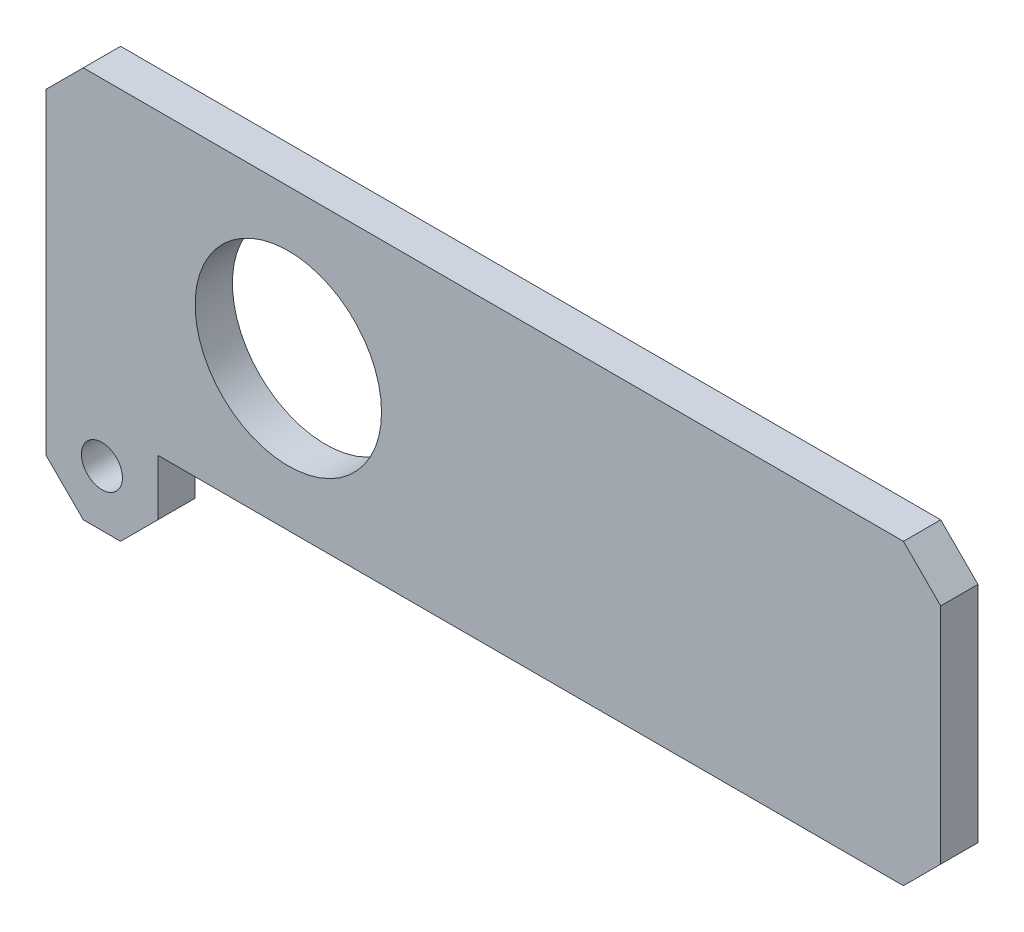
ISO-10303-21;
HEADER;
FILE_DESCRIPTION(('STEP AP214'),'2;1');
FILE_NAME('part.step','',(''),(''),'','','');
FILE_SCHEMA(('AUTOMOTIVE_DESIGN { 1 0 10303 214 1 1 1 1 }'));
ENDSEC;
DATA;
#1=APPLICATION_CONTEXT('core data for automotive mechanical design processes');
#2=APPLICATION_PROTOCOL_DEFINITION('international standard','automotive_design',2000,#1);
#3=PRODUCT_CONTEXT('',#1,'mechanical');
#4=PRODUCT('Part','Part','',(#3));
#5=PRODUCT_RELATED_PRODUCT_CATEGORY('part','',(#4));
#6=PRODUCT_DEFINITION_FORMATION('','',#4);
#7=PRODUCT_DEFINITION_CONTEXT('part definition',#1,'design');
#8=PRODUCT_DEFINITION('design','',#6,#7);
#9=PRODUCT_DEFINITION_SHAPE('','',#8);
#10=(LENGTH_UNIT() NAMED_UNIT(*) SI_UNIT(.MILLI.,.METRE.));
#11=(NAMED_UNIT(*) PLANE_ANGLE_UNIT() SI_UNIT($,.RADIAN.));
#12=(NAMED_UNIT(*) SI_UNIT($,.STERADIAN.) SOLID_ANGLE_UNIT());
#13=UNCERTAINTY_MEASURE_WITH_UNIT(LENGTH_MEASURE(1.E-05),#10,'distance_accuracy_value','');
#14=(GEOMETRIC_REPRESENTATION_CONTEXT(3) GLOBAL_UNCERTAINTY_ASSIGNED_CONTEXT((#13)) GLOBAL_UNIT_ASSIGNED_CONTEXT((#10,
#11,#12)) REPRESENTATION_CONTEXT('',''));
#15=CARTESIAN_POINT('',(0.,0.,0.));
#16=DIRECTION('',(0.,0.,1.));
#17=DIRECTION('',(1.,0.,0.));
#18=AXIS2_PLACEMENT_3D('',#15,#16,#17);
#19=CARTESIAN_POINT('',(30.,0.,10.));
#20=DIRECTION('',(0.,0.,1.));
#21=DIRECTION('',(1.,0.,0.));
#22=AXIS2_PLACEMENT_3D('',#19,#20,#21);
#23=PLANE('',#22);
#24=CARTESIAN_POINT('',(65.,65.,10.));
#25=DIRECTION('',(0.,0.,1.));
#26=DIRECTION('',(1.,0.,0.));
#27=AXIS2_PLACEMENT_3D('',#24,#25,#26);
#28=CIRCLE('',#27,25.);
#29=CARTESIAN_POINT('',(90.,65.,10.));
#30=VERTEX_POINT('',#29);
#31=EDGE_CURVE('E148',#30,#30,#28,.T.);
#32=ORIENTED_EDGE('',*,*,#31,.F.);
#33=EDGE_LOOP('',(#32));
#34=FACE_BOUND('',#33,.T.);
#35=DIRECTION('',(1.,0.,0.));
#36=VECTOR('',#35,1.);
#37=CARTESIAN_POINT('',(240.,25.,10.));
#38=LINE('',#37,#36);
#39=CARTESIAN_POINT('',(30.,25.,10.));
#40=VERTEX_POINT('',#39);
#41=CARTESIAN_POINT('',(230.,25.,10.));
#42=VERTEX_POINT('',#41);
#43=EDGE_CURVE('E118',#40,#42,#38,.T.);
#44=ORIENTED_EDGE('',*,*,#43,.T.);
#45=DIRECTION('',(-0.70710678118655,-0.707106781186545,0.));
#46=VECTOR('',#45,1.);
#47=CARTESIAN_POINT('',(117.499999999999,-87.4999999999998,10.));
#48=LINE('',#47,#46);
#49=CARTESIAN_POINT('',(240.,35.,10.));
#50=VERTEX_POINT('',#49);
#51=EDGE_CURVE('E11',#42,#50,#48,.F.);
#52=ORIENTED_EDGE('',*,*,#51,.T.);
#53=DIRECTION('',(0.,1.,0.));
#54=VECTOR('',#53,1.);
#55=CARTESIAN_POINT('',(240.,105.,10.));
#56=LINE('',#55,#54);
#57=CARTESIAN_POINT('',(240.,95.,10.));
#58=VERTEX_POINT('',#57);
#59=EDGE_CURVE('E137',#50,#58,#56,.T.);
#60=ORIENTED_EDGE('',*,*,#59,.T.);
#61=DIRECTION('',(0.707106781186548,-0.707106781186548,0.));
#62=VECTOR('',#61,1.);
#63=CARTESIAN_POINT('',(182.5,152.5,10.));
#64=LINE('',#63,#62);
#65=CARTESIAN_POINT('',(230.,105.,10.));
#66=VERTEX_POINT('',#65);
#67=EDGE_CURVE('E195',#58,#66,#64,.F.);
#68=ORIENTED_EDGE('',*,*,#67,.T.);
#69=DIRECTION('',(-1.,0.,0.));
#70=VECTOR('',#69,1.);
#71=CARTESIAN_POINT('',(0.,105.,10.));
#72=LINE('',#71,#70);
#73=CARTESIAN_POINT('',(10.,105.,10.));
#74=VERTEX_POINT('',#73);
#75=EDGE_CURVE('E139',#66,#74,#72,.T.);
#76=ORIENTED_EDGE('',*,*,#75,.T.);
#77=DIRECTION('',(0.707106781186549,0.707106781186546,0.));
#78=VECTOR('',#77,1.);
#79=CARTESIAN_POINT('',(-32.4999999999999,62.5000000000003,10.));
#80=LINE('',#79,#78);
#81=CARTESIAN_POINT('',(0.,95.,10.));
#82=VERTEX_POINT('',#81);
#83=EDGE_CURVE('E184',#74,#82,#80,.F.);
#84=ORIENTED_EDGE('',*,*,#83,.T.);
#85=DIRECTION('',(0.,-1.,0.));
#86=VECTOR('',#85,1.);
#87=CARTESIAN_POINT('',(0.,0.,10.));
#88=LINE('',#87,#86);
#89=CARTESIAN_POINT('',(0.,10.0000000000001,10.));
#90=VERTEX_POINT('',#89);
#91=EDGE_CURVE('E134',#82,#90,#88,.T.);
#92=ORIENTED_EDGE('',*,*,#91,.T.);
#93=DIRECTION('',(-0.707106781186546,0.707106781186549,0.));
#94=VECTOR('',#93,1.);
#95=CARTESIAN_POINT('',(19.9999999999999,-9.99999999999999,10.));
#96=LINE('',#95,#94);
#97=CARTESIAN_POINT('',(10.,0.,10.));
#98=VERTEX_POINT('',#97);
#99=EDGE_CURVE('E166',#90,#98,#96,.F.);
#100=ORIENTED_EDGE('',*,*,#99,.T.);
#101=DIRECTION('',(1.,0.,0.));
#102=VECTOR('',#101,1.);
#103=CARTESIAN_POINT('',(30.,0.,10.));
#104=LINE('',#103,#102);
#105=CARTESIAN_POINT('',(19.9999999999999,0.,10.));
#106=VERTEX_POINT('',#105);
#107=EDGE_CURVE('E126',#98,#106,#104,.T.);
#108=ORIENTED_EDGE('',*,*,#107,.T.);
#109=DIRECTION('',(-0.70710678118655,-0.707106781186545,0.));
#110=VECTOR('',#109,1.);
#111=CARTESIAN_POINT('',(25.,5.00000000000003,10.));
#112=LINE('',#111,#110);
#113=CARTESIAN_POINT('',(30.,10.,10.));
#114=VERTEX_POINT('',#113);
#115=EDGE_CURVE('E122',#106,#114,#112,.F.);
#116=ORIENTED_EDGE('',*,*,#115,.T.);
#117=DIRECTION('',(0.,1.,0.));
#118=VECTOR('',#117,1.);
#119=CARTESIAN_POINT('',(30.,25.,10.));
#120=LINE('',#119,#118);
#121=EDGE_CURVE('E115',#114,#40,#120,.T.);
#122=ORIENTED_EDGE('',*,*,#121,.T.);
#123=EDGE_LOOP('',(#44,#52,#60,#68,#76,#84,#92,#100,#108,#116,#122));
#124=FACE_BOUND('',#123,.T.);
#125=CARTESIAN_POINT('',(15.,15.,10.));
#126=DIRECTION('',(0.,0.,1.));
#127=DIRECTION('',(1.,0.,0.));
#128=AXIS2_PLACEMENT_3D('',#125,#126,#127);
#129=CIRCLE('',#128,5.5);
#130=CARTESIAN_POINT('',(20.5,15.,10.));
#131=VERTEX_POINT('',#130);
#132=EDGE_CURVE('E239',#131,#131,#129,.T.);
#133=ORIENTED_EDGE('',*,*,#132,.F.);
#134=EDGE_LOOP('',(#133));
#135=FACE_BOUND('',#134,.T.);
#136=ADVANCED_FACE('F33',(#34,#124,#135),#23,.T.);
#137=CARTESIAN_POINT('',(30.,0.,0.));
#138=DIRECTION('',(0.,0.,1.));
#139=DIRECTION('',(1.,0.,0.));
#140=AXIS2_PLACEMENT_3D('',#137,#138,#139);
#141=PLANE('',#140);
#142=CARTESIAN_POINT('',(65.,65.,0.));
#143=DIRECTION('',(0.,0.,1.));
#144=DIRECTION('',(1.,0.,0.));
#145=AXIS2_PLACEMENT_3D('',#142,#143,#144);
#146=CIRCLE('',#145,25.);
#147=CARTESIAN_POINT('',(90.,65.,0.));
#148=VERTEX_POINT('',#147);
#149=EDGE_CURVE('E236',#148,#148,#146,.T.);
#150=ORIENTED_EDGE('',*,*,#149,.T.);
#151=EDGE_LOOP('',(#150));
#152=FACE_BOUND('',#151,.T.);
#153=DIRECTION('',(0.,1.,0.));
#154=VECTOR('',#153,1.);
#155=CARTESIAN_POINT('',(240.,105.,0.));
#156=LINE('',#155,#154);
#157=CARTESIAN_POINT('',(240.,35.,0.));
#158=VERTEX_POINT('',#157);
#159=CARTESIAN_POINT('',(240.,95.,0.));
#160=VERTEX_POINT('',#159);
#161=EDGE_CURVE('E152',#158,#160,#156,.T.);
#162=ORIENTED_EDGE('',*,*,#161,.F.);
#163=DIRECTION('',(0.70710678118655,0.707106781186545,0.));
#164=VECTOR('',#163,1.);
#165=CARTESIAN_POINT('',(240.,35.,0.));
#166=LINE('',#165,#164);
#167=CARTESIAN_POINT('',(230.,25.,0.));
#168=VERTEX_POINT('',#167);
#169=EDGE_CURVE('E55',#158,#168,#166,.F.);
#170=ORIENTED_EDGE('',*,*,#169,.T.);
#171=DIRECTION('',(1.,0.,0.));
#172=VECTOR('',#171,1.);
#173=CARTESIAN_POINT('',(240.,25.,0.));
#174=LINE('',#173,#172);
#175=CARTESIAN_POINT('',(30.,25.,0.));
#176=VERTEX_POINT('',#175);
#177=EDGE_CURVE('E150',#176,#168,#174,.T.);
#178=ORIENTED_EDGE('',*,*,#177,.F.);
#179=DIRECTION('',(0.,1.,0.));
#180=VECTOR('',#179,1.);
#181=CARTESIAN_POINT('',(30.,25.,0.));
#182=LINE('',#181,#180);
#183=CARTESIAN_POINT('',(30.,10.,0.));
#184=VERTEX_POINT('',#183);
#185=EDGE_CURVE('E132',#184,#176,#182,.T.);
#186=ORIENTED_EDGE('',*,*,#185,.F.);
#187=DIRECTION('',(0.70710678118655,0.707106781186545,0.));
#188=VECTOR('',#187,1.);
#189=CARTESIAN_POINT('',(30.,10.,0.));
#190=LINE('',#189,#188);
#191=CARTESIAN_POINT('',(19.9999999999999,0.,0.));
#192=VERTEX_POINT('',#191);
#193=EDGE_CURVE('E170',#184,#192,#190,.F.);
#194=ORIENTED_EDGE('',*,*,#193,.T.);
#195=DIRECTION('',(1.,0.,0.));
#196=VECTOR('',#195,1.);
#197=CARTESIAN_POINT('',(30.,0.,0.));
#198=LINE('',#197,#196);
#199=CARTESIAN_POINT('',(10.,0.,0.));
#200=VERTEX_POINT('',#199);
#201=EDGE_CURVE('E145',#200,#192,#198,.T.);
#202=ORIENTED_EDGE('',*,*,#201,.F.);
#203=DIRECTION('',(0.707106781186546,-0.707106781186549,0.));
#204=VECTOR('',#203,1.);
#205=CARTESIAN_POINT('',(10.,0.,0.));
#206=LINE('',#205,#204);
#207=CARTESIAN_POINT('',(0.,10.0000000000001,0.));
#208=VERTEX_POINT('',#207);
#209=EDGE_CURVE('E160',#200,#208,#206,.F.);
#210=ORIENTED_EDGE('',*,*,#209,.T.);
#211=DIRECTION('',(0.,-1.,0.));
#212=VECTOR('',#211,1.);
#213=CARTESIAN_POINT('',(0.,0.,0.));
#214=LINE('',#213,#212);
#215=CARTESIAN_POINT('',(0.,95.,0.));
#216=VERTEX_POINT('',#215);
#217=EDGE_CURVE('E156',#216,#208,#214,.T.);
#218=ORIENTED_EDGE('',*,*,#217,.F.);
#219=DIRECTION('',(-0.707106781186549,-0.707106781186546,0.));
#220=VECTOR('',#219,1.);
#221=CARTESIAN_POINT('',(0.,95.,0.));
#222=LINE('',#221,#220);
#223=CARTESIAN_POINT('',(10.0000000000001,105.,0.));
#224=VERTEX_POINT('',#223);
#225=EDGE_CURVE('E178',#216,#224,#222,.F.);
#226=ORIENTED_EDGE('',*,*,#225,.T.);
#227=DIRECTION('',(-1.,0.,0.));
#228=VECTOR('',#227,1.);
#229=CARTESIAN_POINT('',(0.,105.,0.));
#230=LINE('',#229,#228);
#231=CARTESIAN_POINT('',(230.,105.,0.));
#232=VERTEX_POINT('',#231);
#233=EDGE_CURVE('E154',#232,#224,#230,.T.);
#234=ORIENTED_EDGE('',*,*,#233,.F.);
#235=DIRECTION('',(-0.707106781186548,0.707106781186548,0.));
#236=VECTOR('',#235,1.);
#237=CARTESIAN_POINT('',(230.,105.,0.));
#238=LINE('',#237,#236);
#239=EDGE_CURVE('E189',#232,#160,#238,.F.);
#240=ORIENTED_EDGE('',*,*,#239,.T.);
#241=EDGE_LOOP('',(#162,#170,#178,#186,#194,#202,#210,#218,#226,#234,#240));
#242=FACE_BOUND('',#241,.T.);
#243=CARTESIAN_POINT('',(15.,15.,0.));
#244=DIRECTION('',(0.,0.,1.));
#245=DIRECTION('',(1.,0.,0.));
#246=AXIS2_PLACEMENT_3D('',#243,#244,#245);
#247=CIRCLE('',#246,5.5);
#248=CARTESIAN_POINT('',(20.5,15.,0.));
#249=VERTEX_POINT('',#248);
#250=EDGE_CURVE('E242',#249,#249,#247,.T.);
#251=ORIENTED_EDGE('',*,*,#250,.T.);
#252=EDGE_LOOP('',(#251));
#253=FACE_BOUND('',#252,.T.);
#254=ADVANCED_FACE('F205',(#152,#242,#253),#141,.F.);
#255=CARTESIAN_POINT('',(30.,0.,10.));
#256=DIRECTION('',(0.,1.,0.));
#257=DIRECTION('',(-1.,0.,0.));
#258=AXIS2_PLACEMENT_3D('',#255,#256,#257);
#259=PLANE('',#258);
#260=ORIENTED_EDGE('',*,*,#201,.T.);
#261=DIRECTION('',(0.,0.,1.));
#262=VECTOR('',#261,1.);
#263=CARTESIAN_POINT('',(19.9999999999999,0.,10.));
#264=LINE('',#263,#262);
#265=EDGE_CURVE('E172',#192,#106,#264,.T.);
#266=ORIENTED_EDGE('',*,*,#265,.T.);
#267=ORIENTED_EDGE('',*,*,#107,.F.);
#268=DIRECTION('',(0.,0.,-1.));
#269=VECTOR('',#268,1.);
#270=CARTESIAN_POINT('',(10.,0.,10.));
#271=LINE('',#270,#269);
#272=EDGE_CURVE('E133',#98,#200,#271,.T.);
#273=ORIENTED_EDGE('',*,*,#272,.T.);
#274=EDGE_LOOP('',(#260,#266,#267,#273));
#275=FACE_BOUND('',#274,.T.);
#276=ADVANCED_FACE('F232',(#275),#259,.F.);
#277=CARTESIAN_POINT('',(30.,25.,10.));
#278=DIRECTION('',(-1.,0.,0.));
#279=DIRECTION('',(0.,-1.,0.));
#280=AXIS2_PLACEMENT_3D('',#277,#278,#279);
#281=PLANE('',#280);
#282=ORIENTED_EDGE('',*,*,#121,.F.);
#283=DIRECTION('',(0.,0.,-1.));
#284=VECTOR('',#283,1.);
#285=CARTESIAN_POINT('',(30.,10.,10.));
#286=LINE('',#285,#284);
#287=EDGE_CURVE('E168',#114,#184,#286,.T.);
#288=ORIENTED_EDGE('',*,*,#287,.T.);
#289=ORIENTED_EDGE('',*,*,#185,.T.);
#290=DIRECTION('',(0.,0.,-1.));
#291=VECTOR('',#290,1.);
#292=CARTESIAN_POINT('',(30.,25.,10.));
#293=LINE('',#292,#291);
#294=EDGE_CURVE('E129',#40,#176,#293,.T.);
#295=ORIENTED_EDGE('',*,*,#294,.F.);
#296=EDGE_LOOP('',(#282,#288,#289,#295));
#297=FACE_BOUND('',#296,.T.);
#298=ADVANCED_FACE('F130',(#297),#281,.F.);
#299=CARTESIAN_POINT('',(240.,25.,10.));
#300=DIRECTION('',(0.,1.,0.));
#301=DIRECTION('',(-1.,0.,0.));
#302=AXIS2_PLACEMENT_3D('',#299,#300,#301);
#303=PLANE('',#302);
#304=ORIENTED_EDGE('',*,*,#177,.T.);
#305=DIRECTION('',(0.,0.,1.));
#306=VECTOR('',#305,1.);
#307=CARTESIAN_POINT('',(230.,25.,10.));
#308=LINE('',#307,#306);
#309=EDGE_CURVE('E41',#168,#42,#308,.T.);
#310=ORIENTED_EDGE('',*,*,#309,.T.);
#311=ORIENTED_EDGE('',*,*,#43,.F.);
#312=ORIENTED_EDGE('',*,*,#294,.T.);
#313=EDGE_LOOP('',(#304,#310,#311,#312));
#314=FACE_BOUND('',#313,.T.);
#315=ADVANCED_FACE('F136',(#314),#303,.F.);
#316=CARTESIAN_POINT('',(240.,105.,10.));
#317=DIRECTION('',(-1.,0.,0.));
#318=DIRECTION('',(0.,-1.,0.));
#319=AXIS2_PLACEMENT_3D('',#316,#317,#318);
#320=PLANE('',#319);
#321=ORIENTED_EDGE('',*,*,#59,.F.);
#322=DIRECTION('',(0.,0.,-1.));
#323=VECTOR('',#322,1.);
#324=CARTESIAN_POINT('',(240.,35.,10.));
#325=LINE('',#324,#323);
#326=EDGE_CURVE('E197',#50,#158,#325,.T.);
#327=ORIENTED_EDGE('',*,*,#326,.T.);
#328=ORIENTED_EDGE('',*,*,#161,.T.);
#329=DIRECTION('',(0.,0.,1.));
#330=VECTOR('',#329,1.);
#331=CARTESIAN_POINT('',(240.,95.,10.));
#332=LINE('',#331,#330);
#333=EDGE_CURVE('E192',#160,#58,#332,.T.);
#334=ORIENTED_EDGE('',*,*,#333,.T.);
#335=EDGE_LOOP('',(#321,#327,#328,#334));
#336=FACE_BOUND('',#335,.T.);
#337=ADVANCED_FACE('F203',(#336),#320,.F.);
#338=CARTESIAN_POINT('',(0.,105.,10.));
#339=DIRECTION('',(0.,-1.,0.));
#340=DIRECTION('',(0.,0.,-1.));
#341=AXIS2_PLACEMENT_3D('',#338,#339,#340);
#342=PLANE('',#341);
#343=ORIENTED_EDGE('',*,*,#75,.F.);
#344=DIRECTION('',(0.,0.,-1.));
#345=VECTOR('',#344,1.);
#346=CARTESIAN_POINT('',(230.,105.,10.));
#347=LINE('',#346,#345);
#348=EDGE_CURVE('E186',#66,#232,#347,.T.);
#349=ORIENTED_EDGE('',*,*,#348,.T.);
#350=ORIENTED_EDGE('',*,*,#233,.T.);
#351=DIRECTION('',(0.,0.,1.));
#352=VECTOR('',#351,1.);
#353=CARTESIAN_POINT('',(10.0000000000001,105.,10.));
#354=LINE('',#353,#352);
#355=EDGE_CURVE('E181',#224,#74,#354,.T.);
#356=ORIENTED_EDGE('',*,*,#355,.T.);
#357=EDGE_LOOP('',(#343,#349,#350,#356));
#358=FACE_BOUND('',#357,.T.);
#359=ADVANCED_FACE('F215',(#358),#342,.F.);
#360=CARTESIAN_POINT('',(0.,0.,10.));
#361=DIRECTION('',(1.,0.,0.));
#362=DIRECTION('',(0.,0.,-1.));
#363=AXIS2_PLACEMENT_3D('',#360,#361,#362);
#364=PLANE('',#363);
#365=ORIENTED_EDGE('',*,*,#91,.F.);
#366=DIRECTION('',(0.,0.,-1.));
#367=VECTOR('',#366,1.);
#368=CARTESIAN_POINT('',(0.,95.,10.));
#369=LINE('',#368,#367);
#370=EDGE_CURVE('E175',#82,#216,#369,.T.);
#371=ORIENTED_EDGE('',*,*,#370,.T.);
#372=ORIENTED_EDGE('',*,*,#217,.T.);
#373=DIRECTION('',(0.,0.,1.));
#374=VECTOR('',#373,1.);
#375=CARTESIAN_POINT('',(0.,10.0000000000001,10.));
#376=LINE('',#375,#374);
#377=EDGE_CURVE('E163',#208,#90,#376,.T.);
#378=ORIENTED_EDGE('',*,*,#377,.T.);
#379=EDGE_LOOP('',(#365,#371,#372,#378));
#380=FACE_BOUND('',#379,.T.);
#381=ADVANCED_FACE('F223',(#380),#364,.F.);
#382=CARTESIAN_POINT('',(65.,65.,10.));
#383=DIRECTION('',(0.,0.,-1.));
#384=DIRECTION('',(-1.,0.,0.));
#385=AXIS2_PLACEMENT_3D('',#382,#383,#384);
#386=CYLINDRICAL_SURFACE('',#385,25.);
#387=ORIENTED_EDGE('',*,*,#31,.T.);
#388=EDGE_LOOP('',(#387));
#389=FACE_BOUND('',#388,.T.);
#390=ORIENTED_EDGE('',*,*,#149,.F.);
#391=EDGE_LOOP('',(#390));
#392=FACE_BOUND('',#391,.T.);
#393=ADVANCED_FACE('F260',(#389,#392),#386,.F.);
#394=CARTESIAN_POINT('',(15.,15.,10.));
#395=DIRECTION('',(0.,0.,-1.));
#396=DIRECTION('',(-1.,0.,0.));
#397=AXIS2_PLACEMENT_3D('',#394,#395,#396);
#398=CYLINDRICAL_SURFACE('',#397,5.5);
#399=ORIENTED_EDGE('',*,*,#132,.T.);
#400=EDGE_LOOP('',(#399));
#401=FACE_BOUND('',#400,.T.);
#402=ORIENTED_EDGE('',*,*,#250,.F.);
#403=EDGE_LOOP('',(#402));
#404=FACE_BOUND('',#403,.T.);
#405=ADVANCED_FACE('F248',(#401,#404),#398,.F.);
#406=CARTESIAN_POINT('',(10.,0.,10.));
#407=DIRECTION('',(0.707106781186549,0.707106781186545,0.));
#408=DIRECTION('',(-0.707106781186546,0.707106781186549,0.));
#409=AXIS2_PLACEMENT_3D('',#406,#407,#408);
#410=PLANE('',#409);
#411=ORIENTED_EDGE('',*,*,#99,.F.);
#412=ORIENTED_EDGE('',*,*,#377,.F.);
#413=ORIENTED_EDGE('',*,*,#209,.F.);
#414=ORIENTED_EDGE('',*,*,#272,.F.);
#415=EDGE_LOOP('',(#411,#412,#413,#414));
#416=FACE_BOUND('',#415,.T.);
#417=ADVANCED_FACE('F229',(#416),#410,.F.);
#418=CARTESIAN_POINT('',(30.,10.,10.));
#419=DIRECTION('',(-0.707106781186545,0.70710678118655,0.));
#420=DIRECTION('',(-0.70710678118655,-0.707106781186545,0.));
#421=AXIS2_PLACEMENT_3D('',#418,#419,#420);
#422=PLANE('',#421);
#423=ORIENTED_EDGE('',*,*,#115,.F.);
#424=ORIENTED_EDGE('',*,*,#265,.F.);
#425=ORIENTED_EDGE('',*,*,#193,.F.);
#426=ORIENTED_EDGE('',*,*,#287,.F.);
#427=EDGE_LOOP('',(#423,#424,#425,#426));
#428=FACE_BOUND('',#427,.T.);
#429=ADVANCED_FACE('F277',(#428),#422,.F.);
#430=CARTESIAN_POINT('',(0.,95.,10.));
#431=DIRECTION('',(0.707106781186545,-0.707106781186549,0.));
#432=DIRECTION('',(0.707106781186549,0.707106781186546,0.));
#433=AXIS2_PLACEMENT_3D('',#430,#431,#432);
#434=PLANE('',#433);
#435=ORIENTED_EDGE('',*,*,#83,.F.);
#436=ORIENTED_EDGE('',*,*,#355,.F.);
#437=ORIENTED_EDGE('',*,*,#225,.F.);
#438=ORIENTED_EDGE('',*,*,#370,.F.);
#439=EDGE_LOOP('',(#435,#436,#437,#438));
#440=FACE_BOUND('',#439,.T.);
#441=ADVANCED_FACE('F220',(#440),#434,.F.);
#442=CARTESIAN_POINT('',(230.,105.,10.));
#443=DIRECTION('',(-0.707106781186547,-0.707106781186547,0.));
#444=DIRECTION('',(0.707106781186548,-0.707106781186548,0.));
#445=AXIS2_PLACEMENT_3D('',#442,#443,#444);
#446=PLANE('',#445);
#447=ORIENTED_EDGE('',*,*,#67,.F.);
#448=ORIENTED_EDGE('',*,*,#333,.F.);
#449=ORIENTED_EDGE('',*,*,#239,.F.);
#450=ORIENTED_EDGE('',*,*,#348,.F.);
#451=EDGE_LOOP('',(#447,#448,#449,#450));
#452=FACE_BOUND('',#451,.T.);
#453=ADVANCED_FACE('F212',(#452),#446,.F.);
#454=CARTESIAN_POINT('',(240.,35.,10.));
#455=DIRECTION('',(-0.707106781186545,0.70710678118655,0.));
#456=DIRECTION('',(-0.70710678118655,-0.707106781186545,0.));
#457=AXIS2_PLACEMENT_3D('',#454,#455,#456);
#458=PLANE('',#457);
#459=ORIENTED_EDGE('',*,*,#51,.F.);
#460=ORIENTED_EDGE('',*,*,#309,.F.);
#461=ORIENTED_EDGE('',*,*,#169,.F.);
#462=ORIENTED_EDGE('',*,*,#326,.F.);
#463=EDGE_LOOP('',(#459,#460,#461,#462));
#464=FACE_BOUND('',#463,.T.);
#465=ADVANCED_FACE('F35',(#464),#458,.F.);
#466=CLOSED_SHELL('',(#136,#254,#276,#298,#315,#337,#359,#381,#393,#405,#417,#429,#441,#453,#465));
#467=MANIFOLD_SOLID_BREP('B2',#466);
#468=ADVANCED_BREP_SHAPE_REPRESENTATION('',(#18,#467),#14);
#469=SHAPE_DEFINITION_REPRESENTATION(#9,#468);
ENDSEC;
END-ISO-10303-21;
